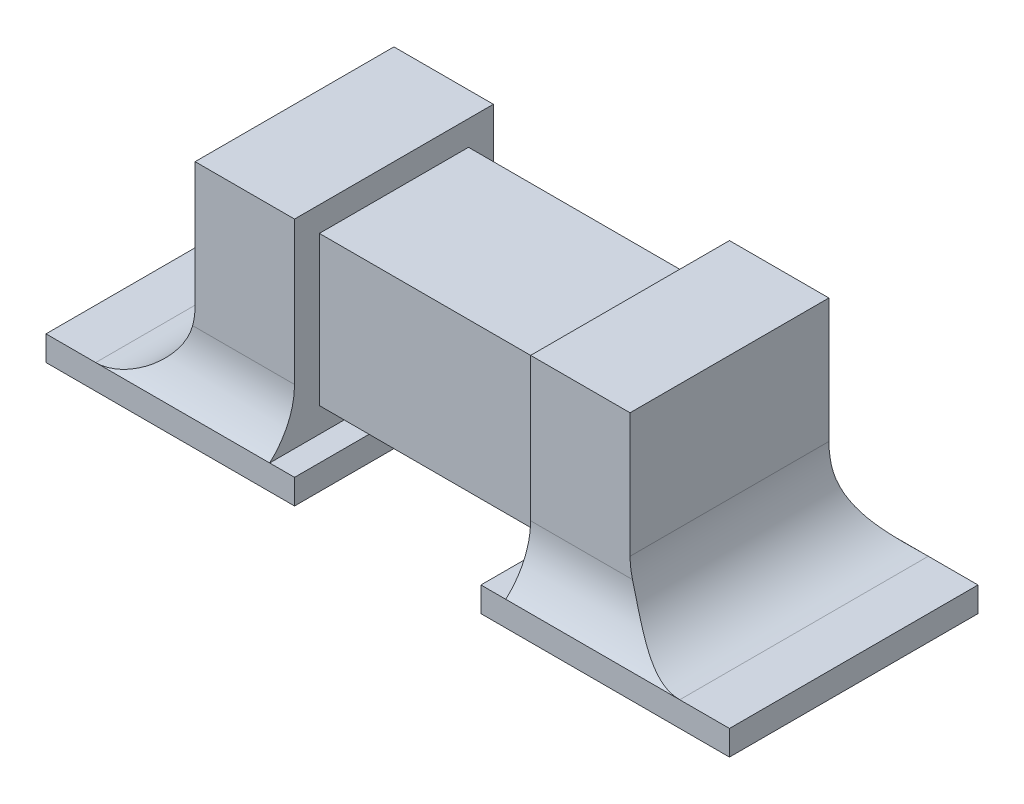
ISO-10303-21;
HEADER;
FILE_DESCRIPTION(('STEP AP214'),'2;1');
FILE_NAME('part.step','',(''),(''),'','','');
FILE_SCHEMA(('AUTOMOTIVE_DESIGN { 1 0 10303 214 1 1 1 1 }'));
ENDSEC;
DATA;
#1=APPLICATION_CONTEXT('core data for automotive mechanical design processes');
#2=APPLICATION_PROTOCOL_DEFINITION('international standard','automotive_design',2000,#1);
#3=PRODUCT_CONTEXT('',#1,'mechanical');
#4=PRODUCT('Part','Part','',(#3));
#5=PRODUCT_RELATED_PRODUCT_CATEGORY('part','',(#4));
#6=PRODUCT_DEFINITION_FORMATION('','',#4);
#7=PRODUCT_DEFINITION_CONTEXT('part definition',#1,'design');
#8=PRODUCT_DEFINITION('design','',#6,#7);
#9=PRODUCT_DEFINITION_SHAPE('','',#8);
#10=(LENGTH_UNIT() NAMED_UNIT(*) SI_UNIT(.MILLI.,.METRE.));
#11=(NAMED_UNIT(*) PLANE_ANGLE_UNIT() SI_UNIT($,.RADIAN.));
#12=(NAMED_UNIT(*) SI_UNIT($,.STERADIAN.) SOLID_ANGLE_UNIT());
#13=UNCERTAINTY_MEASURE_WITH_UNIT(LENGTH_MEASURE(1.E-05),#10,'distance_accuracy_value','');
#14=(GEOMETRIC_REPRESENTATION_CONTEXT(3) GLOBAL_UNCERTAINTY_ASSIGNED_CONTEXT((#13)) GLOBAL_UNIT_ASSIGNED_CONTEXT((#10,
#11,#12)) REPRESENTATION_CONTEXT('',''));
#15=CARTESIAN_POINT('',(0.,0.,0.));
#16=DIRECTION('',(0.,0.,1.));
#17=DIRECTION('',(1.,0.,0.));
#18=AXIS2_PLACEMENT_3D('',#15,#16,#17);
#19=CARTESIAN_POINT('',(0.475,0.9,-0.4));
#20=DIRECTION('',(1.,0.,0.));
#21=DIRECTION('',(0.,0.,-1.));
#22=AXIS2_PLACEMENT_3D('',#19,#20,#21);
#23=PLANE('',#22);
#24=DIRECTION('',(0.,-1.,0.));
#25=VECTOR('',#24,1.);
#26=CARTESIAN_POINT('',(0.474999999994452,0.8,0.3));
#27=LINE('',#26,#25);
#28=CARTESIAN_POINT('',(0.474999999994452,0.8,0.3));
#29=VERTEX_POINT('',#28);
#30=CARTESIAN_POINT('',(0.474999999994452,0.2,0.3));
#31=VERTEX_POINT('',#30);
#32=EDGE_CURVE('E88',#29,#31,#27,.T.);
#33=ORIENTED_EDGE('',*,*,#32,.T.);
#34=DIRECTION('',(0.,0.,-1.));
#35=VECTOR('',#34,1.);
#36=CARTESIAN_POINT('',(0.474999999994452,0.2,0.300000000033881));
#37=LINE('',#36,#35);
#38=CARTESIAN_POINT('',(0.474999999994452,0.2,-0.3));
#39=VERTEX_POINT('',#38);
#40=EDGE_CURVE('E93',#31,#39,#37,.T.);
#41=ORIENTED_EDGE('',*,*,#40,.T.);
#42=DIRECTION('',(0.,1.,0.));
#43=VECTOR('',#42,1.);
#44=CARTESIAN_POINT('',(0.474999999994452,0.8,-0.3));
#45=LINE('',#44,#43);
#46=CARTESIAN_POINT('',(0.474999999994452,0.8,-0.3));
#47=VERTEX_POINT('',#46);
#48=EDGE_CURVE('E90',#39,#47,#45,.T.);
#49=ORIENTED_EDGE('',*,*,#48,.T.);
#50=DIRECTION('',(0.,0.,1.));
#51=VECTOR('',#50,1.);
#52=CARTESIAN_POINT('',(0.474999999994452,0.8,0.300000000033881));
#53=LINE('',#52,#51);
#54=EDGE_CURVE('E47',#47,#29,#53,.T.);
#55=ORIENTED_EDGE('',*,*,#54,.T.);
#56=EDGE_LOOP('',(#33,#41,#49,#55));
#57=FACE_BOUND('',#56,.T.);
#58=ADVANCED_FACE('F43',(#57),#23,.T.);
#59=CARTESIAN_POINT('',(500000.,0.8,0.3));
#60=DIRECTION('',(0.,0.,-1.));
#61=DIRECTION('',(0.,1.,0.));
#62=AXIS2_PLACEMENT_3D('',#59,#60,#61);
#63=PLANE('',#62);
#64=ORIENTED_EDGE('',*,*,#32,.F.);
#65=DIRECTION('',(-1.,0.,0.));
#66=VECTOR('',#65,1.);
#67=CARTESIAN_POINT('',(500000.,0.8,0.3));
#68=LINE('',#67,#66);
#69=CARTESIAN_POINT('',(-0.475,0.8,0.3));
#70=VERTEX_POINT('',#69);
#71=EDGE_CURVE('E59',#29,#70,#68,.T.);
#72=ORIENTED_EDGE('',*,*,#71,.T.);
#73=DIRECTION('',(0.,-1.,0.));
#74=VECTOR('',#73,1.);
#75=CARTESIAN_POINT('',(-0.475,0.8,0.3));
#76=LINE('',#75,#74);
#77=CARTESIAN_POINT('',(-0.475,0.2,0.3));
#78=VERTEX_POINT('',#77);
#79=EDGE_CURVE('E12',#70,#78,#76,.T.);
#80=ORIENTED_EDGE('',*,*,#79,.T.);
#81=DIRECTION('',(-1.,0.,0.));
#82=VECTOR('',#81,1.);
#83=CARTESIAN_POINT('',(500000.,0.2,0.3));
#84=LINE('',#83,#82);
#85=EDGE_CURVE('E92',#31,#78,#84,.T.);
#86=ORIENTED_EDGE('',*,*,#85,.F.);
#87=EDGE_LOOP('',(#64,#72,#80,#86));
#88=FACE_BOUND('',#87,.T.);
#89=ADVANCED_FACE('F91',(#88),#63,.F.);
#90=CARTESIAN_POINT('',(500000.,0.2,0.3));
#91=DIRECTION('',(0.,1.,0.));
#92=DIRECTION('',(0.,0.,1.));
#93=AXIS2_PLACEMENT_3D('',#90,#91,#92);
#94=PLANE('',#93);
#95=ORIENTED_EDGE('',*,*,#40,.F.);
#96=ORIENTED_EDGE('',*,*,#85,.T.);
#97=DIRECTION('',(0.,0.,-1.));
#98=VECTOR('',#97,1.);
#99=CARTESIAN_POINT('',(-0.475,0.2,0.3));
#100=LINE('',#99,#98);
#101=CARTESIAN_POINT('',(-0.475,0.2,-0.3));
#102=VERTEX_POINT('',#101);
#103=EDGE_CURVE('E52',#78,#102,#100,.T.);
#104=ORIENTED_EDGE('',*,*,#103,.T.);
#105=DIRECTION('',(-1.,0.,0.));
#106=VECTOR('',#105,1.);
#107=CARTESIAN_POINT('',(500000.,0.2,-0.3));
#108=LINE('',#107,#106);
#109=EDGE_CURVE('E101',#39,#102,#108,.T.);
#110=ORIENTED_EDGE('',*,*,#109,.F.);
#111=EDGE_LOOP('',(#95,#96,#104,#110));
#112=FACE_BOUND('',#111,.T.);
#113=ADVANCED_FACE('F108',(#112),#94,.F.);
#114=CARTESIAN_POINT('',(500000.,0.8,-0.3));
#115=DIRECTION('',(0.,0.,1.));
#116=DIRECTION('',(0.,-1.,0.));
#117=AXIS2_PLACEMENT_3D('',#114,#115,#116);
#118=PLANE('',#117);
#119=ORIENTED_EDGE('',*,*,#48,.F.);
#120=ORIENTED_EDGE('',*,*,#109,.T.);
#121=DIRECTION('',(0.,1.,0.));
#122=VECTOR('',#121,1.);
#123=CARTESIAN_POINT('',(-0.475,0.8,-0.3));
#124=LINE('',#123,#122);
#125=CARTESIAN_POINT('',(-0.475,0.8,-0.3));
#126=VERTEX_POINT('',#125);
#127=EDGE_CURVE('E99',#102,#126,#124,.T.);
#128=ORIENTED_EDGE('',*,*,#127,.T.);
#129=DIRECTION('',(-1.,0.,0.));
#130=VECTOR('',#129,1.);
#131=CARTESIAN_POINT('',(500000.,0.8,-0.3));
#132=LINE('',#131,#130);
#133=EDGE_CURVE('E66',#47,#126,#132,.T.);
#134=ORIENTED_EDGE('',*,*,#133,.F.);
#135=EDGE_LOOP('',(#119,#120,#128,#134));
#136=FACE_BOUND('',#135,.T.);
#137=ADVANCED_FACE('F115',(#136),#118,.F.);
#138=CARTESIAN_POINT('',(500000.,0.8,0.3));
#139=DIRECTION('',(0.,-1.,0.));
#140=DIRECTION('',(0.,0.,-1.));
#141=AXIS2_PLACEMENT_3D('',#138,#139,#140);
#142=PLANE('',#141);
#143=ORIENTED_EDGE('',*,*,#54,.F.);
#144=ORIENTED_EDGE('',*,*,#133,.T.);
#145=DIRECTION('',(0.,0.,1.));
#146=VECTOR('',#145,1.);
#147=CARTESIAN_POINT('',(-0.475,0.8,0.3));
#148=LINE('',#147,#146);
#149=EDGE_CURVE('E96',#126,#70,#148,.T.);
#150=ORIENTED_EDGE('',*,*,#149,.T.);
#151=ORIENTED_EDGE('',*,*,#71,.F.);
#152=EDGE_LOOP('',(#143,#144,#150,#151));
#153=FACE_BOUND('',#152,.T.);
#154=ADVANCED_FACE('F45',(#153),#142,.F.);
#155=CARTESIAN_POINT('',(-0.475,0.,0.));
#156=DIRECTION('',(1.,0.,0.));
#157=DIRECTION('',(0.,0.,-1.));
#158=AXIS2_PLACEMENT_3D('',#155,#156,#157);
#159=PLANE('',#158);
#160=ORIENTED_EDGE('',*,*,#79,.F.);
#161=ORIENTED_EDGE('',*,*,#149,.F.);
#162=ORIENTED_EDGE('',*,*,#127,.F.);
#163=ORIENTED_EDGE('',*,*,#103,.F.);
#164=EDGE_LOOP('',(#160,#161,#162,#163));
#165=FACE_BOUND('',#164,.T.);
#166=ADVANCED_FACE('F117',(#165),#159,.F.);
#167=CLOSED_SHELL('',(#58,#89,#113,#137,#154,#166));
#168=MANIFOLD_SOLID_BREP('B2',#167);
#169=CARTESIAN_POINT('',(0.,0.1,0.));
#170=DIRECTION('',(0.,1.,0.));
#171=DIRECTION('',(0.,0.,1.));
#172=AXIS2_PLACEMENT_3D('',#169,#170,#171);
#173=PLANE('',#172);
#174=DIRECTION('',(0.,0.,1.));
#175=VECTOR('',#174,1.);
#176=CARTESIAN_POINT('',(0.475,0.1,-0.4));
#177=LINE('',#176,#175);
#178=CARTESIAN_POINT('',(0.475,0.1,-0.5));
#179=VERTEX_POINT('',#178);
#180=CARTESIAN_POINT('',(0.475,0.1,0.5));
#181=VERTEX_POINT('',#180);
#182=EDGE_CURVE('E284',#179,#181,#177,.T.);
#183=ORIENTED_EDGE('',*,*,#182,.F.);
#184=DIRECTION('',(-1.,0.,0.));
#185=VECTOR('',#184,1.);
#186=CARTESIAN_POINT('',(0.375,0.1,-0.5));
#187=LINE('',#186,#185);
#188=CARTESIAN_POINT('',(0.375,0.1,-0.5));
#189=VERTEX_POINT('',#188);
#190=EDGE_CURVE('E308',#179,#189,#187,.T.);
#191=ORIENTED_EDGE('',*,*,#190,.T.);
#192=DIRECTION('',(0.,0.,1.));
#193=VECTOR('',#192,1.);
#194=CARTESIAN_POINT('',(0.375,0.1,-0.5));
#195=LINE('',#194,#193);
#196=CARTESIAN_POINT('',(0.375,0.1,0.5));
#197=VERTEX_POINT('',#196);
#198=EDGE_CURVE('E297',#189,#197,#195,.T.);
#199=ORIENTED_EDGE('',*,*,#198,.T.);
#200=DIRECTION('',(1.,0.,0.));
#201=VECTOR('',#200,1.);
#202=CARTESIAN_POINT('',(0.375,0.1,0.5));
#203=LINE('',#202,#201);
#204=EDGE_CURVE('E302',#197,#181,#203,.T.);
#205=ORIENTED_EDGE('',*,*,#204,.T.);
#206=EDGE_LOOP('',(#183,#191,#199,#205));
#207=FACE_BOUND('',#206,.T.);
#208=ADVANCED_FACE('F175',(#207),#173,.T.);
#209=CARTESIAN_POINT('',(1.375,0.1,-0.5));
#210=VERTEX_POINT('',#209);
#211=CARTESIAN_POINT('',(1.175,0.1,-0.5));
#212=VERTEX_POINT('',#211);
#213=EDGE_CURVE('E309',#210,#212,#187,.T.);
#214=ORIENTED_EDGE('',*,*,#213,.T.);
#215=DIRECTION('',(0.,0.,-1.));
#216=VECTOR('',#215,1.);
#217=CARTESIAN_POINT('',(1.175,0.1,0.));
#218=LINE('',#217,#216);
#219=CARTESIAN_POINT('',(1.175,0.1,0.5));
#220=VERTEX_POINT('',#219);
#221=EDGE_CURVE('E330',#212,#220,#218,.F.);
#222=ORIENTED_EDGE('',*,*,#221,.T.);
#223=CARTESIAN_POINT('',(1.375,0.1,0.5));
#224=VERTEX_POINT('',#223);
#225=EDGE_CURVE('E300',#220,#224,#203,.T.);
#226=ORIENTED_EDGE('',*,*,#225,.T.);
#227=DIRECTION('',(0.,0.,-1.));
#228=VECTOR('',#227,1.);
#229=CARTESIAN_POINT('',(1.375,0.1,-0.5));
#230=LINE('',#229,#228);
#231=EDGE_CURVE('E305',#224,#210,#230,.T.);
#232=ORIENTED_EDGE('',*,*,#231,.T.);
#233=EDGE_LOOP('',(#214,#222,#226,#232));
#234=FACE_BOUND('',#233,.T.);
#235=ADVANCED_FACE('F356',(#234),#173,.T.);
#236=CARTESIAN_POINT('',(0.375,0.1,-0.5));
#237=DIRECTION('',(1.,0.,0.));
#238=DIRECTION('',(0.,0.,-1.));
#239=AXIS2_PLACEMENT_3D('',#236,#237,#238);
#240=PLANE('',#239);
#241=DIRECTION('',(0.,0.,1.));
#242=VECTOR('',#241,1.);
#243=CARTESIAN_POINT('',(0.375,0.,-0.5));
#244=LINE('',#243,#242);
#245=CARTESIAN_POINT('',(0.375,0.,-0.5));
#246=VERTEX_POINT('',#245);
#247=CARTESIAN_POINT('',(0.375,0.,0.5));
#248=VERTEX_POINT('',#247);
#249=EDGE_CURVE('E288',#246,#248,#244,.T.);
#250=ORIENTED_EDGE('',*,*,#249,.T.);
#251=DIRECTION('',(0.,-1.,0.));
#252=VECTOR('',#251,1.);
#253=CARTESIAN_POINT('',(0.375,0.1,0.5));
#254=LINE('',#253,#252);
#255=EDGE_CURVE('E326',#197,#248,#254,.T.);
#256=ORIENTED_EDGE('',*,*,#255,.F.);
#257=ORIENTED_EDGE('',*,*,#198,.F.);
#258=DIRECTION('',(0.,-1.,0.));
#259=VECTOR('',#258,1.);
#260=CARTESIAN_POINT('',(0.375,0.1,-0.5));
#261=LINE('',#260,#259);
#262=EDGE_CURVE('E311',#189,#246,#261,.T.);
#263=ORIENTED_EDGE('',*,*,#262,.T.);
#264=EDGE_LOOP('',(#250,#256,#257,#263));
#265=FACE_BOUND('',#264,.T.);
#266=ADVANCED_FACE('F362',(#265),#240,.F.);
#267=CARTESIAN_POINT('',(0.375,0.1,0.5));
#268=DIRECTION('',(0.,0.,-1.));
#269=DIRECTION('',(-1.,0.,0.));
#270=AXIS2_PLACEMENT_3D('',#267,#268,#269);
#271=PLANE('',#270);
#272=DIRECTION('',(1.,0.,0.));
#273=VECTOR('',#272,1.);
#274=CARTESIAN_POINT('',(0.375,0.,0.5));
#275=LINE('',#274,#273);
#276=CARTESIAN_POINT('',(1.375,0.,0.5));
#277=VERTEX_POINT('',#276);
#278=EDGE_CURVE('E291',#248,#277,#275,.T.);
#279=ORIENTED_EDGE('',*,*,#278,.T.);
#280=DIRECTION('',(0.,-1.,0.));
#281=VECTOR('',#280,1.);
#282=CARTESIAN_POINT('',(1.375,0.1,0.5));
#283=LINE('',#282,#281);
#284=EDGE_CURVE('E323',#224,#277,#283,.T.);
#285=ORIENTED_EDGE('',*,*,#284,.F.);
#286=ORIENTED_EDGE('',*,*,#225,.F.);
#287=EDGE_CURVE('E306',#181,#220,#203,.T.);
#288=ORIENTED_EDGE('',*,*,#287,.F.);
#289=ORIENTED_EDGE('',*,*,#204,.F.);
#290=ORIENTED_EDGE('',*,*,#255,.T.);
#291=EDGE_LOOP('',(#279,#285,#286,#288,#289,#290));
#292=FACE_BOUND('',#291,.T.);
#293=ADVANCED_FACE('F378',(#292),#271,.F.);
#294=CARTESIAN_POINT('',(1.375,0.1,-0.5));
#295=DIRECTION('',(-1.,0.,0.));
#296=DIRECTION('',(0.,0.,1.));
#297=AXIS2_PLACEMENT_3D('',#294,#295,#296);
#298=PLANE('',#297);
#299=DIRECTION('',(0.,0.,-1.));
#300=VECTOR('',#299,1.);
#301=CARTESIAN_POINT('',(1.375,0.,-0.5));
#302=LINE('',#301,#300);
#303=CARTESIAN_POINT('',(1.375,0.,-0.5));
#304=VERTEX_POINT('',#303);
#305=EDGE_CURVE('E315',#277,#304,#302,.T.);
#306=ORIENTED_EDGE('',*,*,#305,.T.);
#307=DIRECTION('',(0.,-1.,0.));
#308=VECTOR('',#307,1.);
#309=CARTESIAN_POINT('',(1.375,0.1,-0.5));
#310=LINE('',#309,#308);
#311=EDGE_CURVE('E320',#210,#304,#310,.T.);
#312=ORIENTED_EDGE('',*,*,#311,.F.);
#313=ORIENTED_EDGE('',*,*,#231,.F.);
#314=ORIENTED_EDGE('',*,*,#284,.T.);
#315=EDGE_LOOP('',(#306,#312,#313,#314));
#316=FACE_BOUND('',#315,.T.);
#317=ADVANCED_FACE('F374',(#316),#298,.F.);
#318=CARTESIAN_POINT('',(0.375,0.1,-0.5));
#319=DIRECTION('',(0.,0.,1.));
#320=DIRECTION('',(1.,0.,0.));
#321=AXIS2_PLACEMENT_3D('',#318,#319,#320);
#322=PLANE('',#321);
#323=DIRECTION('',(-1.,0.,0.));
#324=VECTOR('',#323,1.);
#325=CARTESIAN_POINT('',(0.375,0.,-0.5));
#326=LINE('',#325,#324);
#327=EDGE_CURVE('E301',#304,#246,#326,.T.);
#328=ORIENTED_EDGE('',*,*,#327,.T.);
#329=ORIENTED_EDGE('',*,*,#262,.F.);
#330=ORIENTED_EDGE('',*,*,#190,.F.);
#331=EDGE_CURVE('E312',#212,#179,#187,.T.);
#332=ORIENTED_EDGE('',*,*,#331,.F.);
#333=ORIENTED_EDGE('',*,*,#213,.F.);
#334=ORIENTED_EDGE('',*,*,#311,.T.);
#335=EDGE_LOOP('',(#328,#329,#330,#332,#333,#334));
#336=FACE_BOUND('',#335,.T.);
#337=ADVANCED_FACE('F370',(#336),#322,.F.);
#338=CARTESIAN_POINT('',(0.,0.,0.));
#339=DIRECTION('',(0.,1.,0.));
#340=DIRECTION('',(0.,0.,1.));
#341=AXIS2_PLACEMENT_3D('',#338,#339,#340);
#342=PLANE('',#341);
#343=ORIENTED_EDGE('',*,*,#249,.F.);
#344=ORIENTED_EDGE('',*,*,#327,.F.);
#345=ORIENTED_EDGE('',*,*,#305,.F.);
#346=ORIENTED_EDGE('',*,*,#278,.F.);
#347=EDGE_LOOP('',(#343,#344,#345,#346));
#348=FACE_BOUND('',#347,.T.);
#349=ADVANCED_FACE('F367',(#348),#342,.F.);
#350=CARTESIAN_POINT('',(0.475,0.9,-0.4));
#351=DIRECTION('',(1.,0.,0.));
#352=DIRECTION('',(0.,0.,-1.));
#353=AXIS2_PLACEMENT_3D('',#350,#351,#352);
#354=PLANE('',#353);
#355=ORIENTED_EDGE('',*,*,#182,.T.);
#356=CARTESIAN_POINT('',(0.475,0.323606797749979,0.7));
#357=DIRECTION('',(1.,0.,0.));
#358=DIRECTION('',(0.,0.,-1.));
#359=AXIS2_PLACEMENT_3D('',#356,#357,#358);
#360=CIRCLE('',#359,0.3);
#361=CARTESIAN_POINT('',(0.475,0.323606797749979,0.4));
#362=VERTEX_POINT('',#361);
#363=EDGE_CURVE('E41',#181,#362,#360,.T.);
#364=ORIENTED_EDGE('',*,*,#363,.T.);
#365=DIRECTION('',(0.,-1.,0.));
#366=VECTOR('',#365,1.);
#367=CARTESIAN_POINT('',(0.475,0.9,0.4));
#368=LINE('',#367,#366);
#369=CARTESIAN_POINT('',(0.475,0.9,0.4));
#370=VERTEX_POINT('',#369);
#371=EDGE_CURVE('E269',#370,#362,#368,.T.);
#372=ORIENTED_EDGE('',*,*,#371,.F.);
#373=DIRECTION('',(0.,0.,1.));
#374=VECTOR('',#373,1.);
#375=CARTESIAN_POINT('',(0.475,0.9,-0.4));
#376=LINE('',#375,#374);
#377=CARTESIAN_POINT('',(0.475,0.9,-0.4));
#378=VERTEX_POINT('',#377);
#379=EDGE_CURVE('E275',#378,#370,#376,.T.);
#380=ORIENTED_EDGE('',*,*,#379,.F.);
#381=DIRECTION('',(0.,-1.,0.));
#382=VECTOR('',#381,1.);
#383=CARTESIAN_POINT('',(0.475,0.9,-0.4));
#384=LINE('',#383,#382);
#385=CARTESIAN_POINT('',(0.475,0.323606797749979,-0.4));
#386=VERTEX_POINT('',#385);
#387=EDGE_CURVE('E411',#378,#386,#384,.T.);
#388=ORIENTED_EDGE('',*,*,#387,.T.);
#389=CARTESIAN_POINT('',(0.475,0.323606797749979,-0.7));
#390=DIRECTION('',(1.,0.,0.));
#391=DIRECTION('',(0.,0.,-1.));
#392=AXIS2_PLACEMENT_3D('',#389,#390,#391);
#393=CIRCLE('',#392,0.3);
#394=EDGE_CURVE('E335',#386,#179,#393,.T.);
#395=ORIENTED_EDGE('',*,*,#394,.T.);
#396=EDGE_LOOP('',(#355,#364,#372,#380,#388,#395));
#397=FACE_BOUND('',#396,.T.);
#398=ADVANCED_FACE('F286',(#397),#354,.F.);
#399=CARTESIAN_POINT('',(0.475,0.9,0.4));
#400=DIRECTION('',(0.,0.,-1.));
#401=DIRECTION('',(-1.,0.,0.));
#402=AXIS2_PLACEMENT_3D('',#399,#400,#401);
#403=PLANE('',#402);
#404=ORIENTED_EDGE('',*,*,#371,.T.);
#405=DIRECTION('',(-1.,0.,0.));
#406=VECTOR('',#405,1.);
#407=CARTESIAN_POINT('',(0.475,0.323606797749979,0.4));
#408=LINE('',#407,#406);
#409=CARTESIAN_POINT('',(0.884889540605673,0.323606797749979,0.4));
#410=VERTEX_POINT('',#409);
#411=EDGE_CURVE('E198',#362,#410,#408,.F.);
#412=ORIENTED_EDGE('',*,*,#411,.T.);
#413=CARTESIAN_POINT('',(1.175,0.4,0.4));
#414=DIRECTION('',(0.,0.,-1.));
#415=DIRECTION('',(-1.,0.,0.));
#416=AXIS2_PLACEMENT_3D('',#413,#414,#415);
#417=CIRCLE('',#416,0.3);
#418=CARTESIAN_POINT('',(0.875,0.4,0.4));
#419=VERTEX_POINT('',#418);
#420=EDGE_CURVE('E190',#410,#419,#417,.T.);
#421=ORIENTED_EDGE('',*,*,#420,.T.);
#422=DIRECTION('',(0.,-1.,0.));
#423=VECTOR('',#422,1.);
#424=CARTESIAN_POINT('',(0.875,0.9,0.4));
#425=LINE('',#424,#423);
#426=CARTESIAN_POINT('',(0.875,0.9,0.4));
#427=VERTEX_POINT('',#426);
#428=EDGE_CURVE('E271',#427,#419,#425,.T.);
#429=ORIENTED_EDGE('',*,*,#428,.F.);
#430=DIRECTION('',(1.,0.,0.));
#431=VECTOR('',#430,1.);
#432=CARTESIAN_POINT('',(0.475,0.9,0.4));
#433=LINE('',#432,#431);
#434=EDGE_CURVE('E265',#370,#427,#433,.T.);
#435=ORIENTED_EDGE('',*,*,#434,.F.);
#436=EDGE_LOOP('',(#404,#412,#421,#429,#435));
#437=FACE_BOUND('',#436,.T.);
#438=ADVANCED_FACE('F267',(#437),#403,.F.);
#439=CARTESIAN_POINT('',(0.875,0.9,-0.4));
#440=DIRECTION('',(-1.,0.,0.));
#441=DIRECTION('',(0.,0.,1.));
#442=AXIS2_PLACEMENT_3D('',#439,#440,#441);
#443=PLANE('',#442);
#444=ORIENTED_EDGE('',*,*,#428,.T.);
#445=DIRECTION('',(0.,0.,-1.));
#446=VECTOR('',#445,1.);
#447=CARTESIAN_POINT('',(0.875,0.4,-0.4));
#448=LINE('',#447,#446);
#449=CARTESIAN_POINT('',(0.875,0.4,-0.4));
#450=VERTEX_POINT('',#449);
#451=EDGE_CURVE('E332',#419,#450,#448,.T.);
#452=ORIENTED_EDGE('',*,*,#451,.T.);
#453=DIRECTION('',(0.,-1.,0.));
#454=VECTOR('',#453,1.);
#455=CARTESIAN_POINT('',(0.875,0.9,-0.4));
#456=LINE('',#455,#454);
#457=CARTESIAN_POINT('',(0.875,0.9,-0.4));
#458=VERTEX_POINT('',#457);
#459=EDGE_CURVE('E293',#458,#450,#456,.T.);
#460=ORIENTED_EDGE('',*,*,#459,.F.);
#461=DIRECTION('',(0.,0.,-1.));
#462=VECTOR('',#461,1.);
#463=CARTESIAN_POINT('',(0.875,0.9,-0.4));
#464=LINE('',#463,#462);
#465=EDGE_CURVE('E274',#427,#458,#464,.T.);
#466=ORIENTED_EDGE('',*,*,#465,.F.);
#467=EDGE_LOOP('',(#444,#452,#460,#466));
#468=FACE_BOUND('',#467,.T.);
#469=ADVANCED_FACE('F418',(#468),#443,.F.);
#470=CARTESIAN_POINT('',(0.475,0.9,-0.4));
#471=DIRECTION('',(0.,0.,1.));
#472=DIRECTION('',(1.,0.,0.));
#473=AXIS2_PLACEMENT_3D('',#470,#471,#472);
#474=PLANE('',#473);
#475=ORIENTED_EDGE('',*,*,#459,.T.);
#476=CARTESIAN_POINT('',(1.175,0.4,-0.4));
#477=DIRECTION('',(0.,0.,1.));
#478=DIRECTION('',(1.,0.,0.));
#479=AXIS2_PLACEMENT_3D('',#476,#477,#478);
#480=CIRCLE('',#479,0.3);
#481=CARTESIAN_POINT('',(0.884889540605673,0.323606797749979,-0.4));
#482=VERTEX_POINT('',#481);
#483=EDGE_CURVE('E338',#450,#482,#480,.T.);
#484=ORIENTED_EDGE('',*,*,#483,.T.);
#485=DIRECTION('',(1.,0.,0.));
#486=VECTOR('',#485,1.);
#487=CARTESIAN_POINT('',(0.475,0.323606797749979,-0.4));
#488=LINE('',#487,#486);
#489=EDGE_CURVE('E206',#482,#386,#488,.F.);
#490=ORIENTED_EDGE('',*,*,#489,.T.);
#491=ORIENTED_EDGE('',*,*,#387,.F.);
#492=DIRECTION('',(-1.,0.,0.));
#493=VECTOR('',#492,1.);
#494=CARTESIAN_POINT('',(0.475,0.9,-0.4));
#495=LINE('',#494,#493);
#496=EDGE_CURVE('E280',#458,#378,#495,.T.);
#497=ORIENTED_EDGE('',*,*,#496,.F.);
#498=EDGE_LOOP('',(#475,#484,#490,#491,#497));
#499=FACE_BOUND('',#498,.T.);
#500=ADVANCED_FACE('F416',(#499),#474,.F.);
#501=CARTESIAN_POINT('',(0.,0.9,0.));
#502=DIRECTION('',(0.,1.,0.));
#503=DIRECTION('',(0.,0.,1.));
#504=AXIS2_PLACEMENT_3D('',#501,#502,#503);
#505=PLANE('',#504);
#506=ORIENTED_EDGE('',*,*,#379,.T.);
#507=ORIENTED_EDGE('',*,*,#434,.T.);
#508=ORIENTED_EDGE('',*,*,#465,.T.);
#509=ORIENTED_EDGE('',*,*,#496,.T.);
#510=EDGE_LOOP('',(#506,#507,#508,#509));
#511=FACE_BOUND('',#510,.T.);
#512=ADVANCED_FACE('F278',(#511),#505,.T.);
#513=CARTESIAN_POINT('',(0.,0.323606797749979,0.7));
#514=DIRECTION('',(-1.,0.,0.));
#515=DIRECTION('',(0.,0.,1.));
#516=AXIS2_PLACEMENT_3D('',#513,#514,#515);
#517=CYLINDRICAL_SURFACE('',#516,0.3);
#518=ORIENTED_EDGE('',*,*,#363,.F.);
#519=ORIENTED_EDGE('',*,*,#287,.T.);
#520=CARTESIAN_POINT('',(1.175,0.1,0.5));
#521=CARTESIAN_POINT('',(1.16046022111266,0.0999816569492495,0.500065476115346));
#522=CARTESIAN_POINT('',(1.1460357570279,0.101054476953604,0.498814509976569));
#523=CARTESIAN_POINT('',(1.11796604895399,0.105140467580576,0.494365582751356));
#524=CARTESIAN_POINT('',(1.10431276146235,0.108126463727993,0.491194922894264));
#525=CARTESIAN_POINT('',(1.07498976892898,0.11665828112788,0.482713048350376));
#526=CARTESIAN_POINT('',(1.0595423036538,0.122624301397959,0.477083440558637));
#527=CARTESIAN_POINT('',(1.02998952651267,0.136860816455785,0.465022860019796));
#528=CARTESIAN_POINT('',(1.01589296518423,0.145145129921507,0.458587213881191));
#529=CARTESIAN_POINT('',(0.988938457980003,0.164081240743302,0.445666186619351));
#530=CARTESIAN_POINT('',(0.976109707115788,0.174775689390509,0.439182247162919));
#531=CARTESIAN_POINT('',(0.952231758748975,0.19837060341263,0.427069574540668));
#532=CARTESIAN_POINT('',(0.94117789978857,0.211265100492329,0.421438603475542));
#533=CARTESIAN_POINT('',(0.923455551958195,0.235982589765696,0.412854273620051));
#534=CARTESIAN_POINT('',(0.916360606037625,0.247388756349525,0.409583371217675));
#535=CARTESIAN_POINT('',(0.90368656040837,0.271275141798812,0.404349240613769));
#536=CARTESIAN_POINT('',(0.898103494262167,0.283752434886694,0.402382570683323));
#537=CARTESIAN_POINT('',(0.890131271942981,0.30544761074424,0.400416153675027));
#538=CARTESIAN_POINT('',(0.887289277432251,0.314465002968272,0.399993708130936));
#539=CARTESIAN_POINT('',(0.884889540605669,0.323606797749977,0.399999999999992));
#540=B_SPLINE_CURVE_WITH_KNOTS('',3,(#520,#521,#522,#523,#524,#525,#526,#527,#528,#529,#530,
#531,#532,#533,#534,#535,#536,#537,#538,#539),.UNSPECIFIED.,.F.,.F.,(4,2,2,2,2,2,2,2,2,4),(0.,
0.0433450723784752,0.0860877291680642,0.138287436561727,0.190805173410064,0.244337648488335,
0.297727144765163,0.339046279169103,0.380255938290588,0.408582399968),.UNSPECIFIED.);
#541=EDGE_CURVE('E180',#410,#220,#540,.F.);
#542=ORIENTED_EDGE('',*,*,#541,.F.);
#543=ORIENTED_EDGE('',*,*,#411,.F.);
#544=EDGE_LOOP('',(#518,#519,#542,#543));
#545=FACE_BOUND('',#544,.T.);
#546=ADVANCED_FACE('F177',(#545),#517,.F.);
#547=CARTESIAN_POINT('',(1.175,0.4,-0.4));
#548=DIRECTION('',(0.,0.,-1.));
#549=DIRECTION('',(-1.,0.,0.));
#550=AXIS2_PLACEMENT_3D('',#547,#548,#549);
#551=CYLINDRICAL_SURFACE('',#550,0.3);
#552=ORIENTED_EDGE('',*,*,#541,.T.);
#553=ORIENTED_EDGE('',*,*,#221,.F.);
#554=CARTESIAN_POINT('',(1.175,0.1,-0.5));
#555=CARTESIAN_POINT('',(1.16046022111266,0.0999816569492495,-0.500065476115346));
#556=CARTESIAN_POINT('',(1.1460357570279,0.101054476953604,-0.498814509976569));
#557=CARTESIAN_POINT('',(1.11796604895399,0.105140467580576,-0.494365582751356));
#558=CARTESIAN_POINT('',(1.10431276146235,0.108126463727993,-0.491194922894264));
#559=CARTESIAN_POINT('',(1.07498976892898,0.11665828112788,-0.482713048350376));
#560=CARTESIAN_POINT('',(1.0595423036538,0.122624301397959,-0.477083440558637));
#561=CARTESIAN_POINT('',(1.02998952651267,0.136860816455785,-0.465022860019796));
#562=CARTESIAN_POINT('',(1.01589296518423,0.145145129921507,-0.458587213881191));
#563=CARTESIAN_POINT('',(0.988938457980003,0.164081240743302,-0.445666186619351));
#564=CARTESIAN_POINT('',(0.976109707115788,0.174775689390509,-0.439182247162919));
#565=CARTESIAN_POINT('',(0.952231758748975,0.19837060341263,-0.427069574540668));
#566=CARTESIAN_POINT('',(0.94117789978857,0.211265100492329,-0.421438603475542));
#567=CARTESIAN_POINT('',(0.923455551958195,0.235982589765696,-0.412854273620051));
#568=CARTESIAN_POINT('',(0.916360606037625,0.247388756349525,-0.409583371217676));
#569=CARTESIAN_POINT('',(0.90368656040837,0.271275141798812,-0.404349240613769));
#570=CARTESIAN_POINT('',(0.898103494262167,0.283752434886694,-0.402382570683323));
#571=CARTESIAN_POINT('',(0.890131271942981,0.30544761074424,-0.400416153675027));
#572=CARTESIAN_POINT('',(0.887289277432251,0.314465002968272,-0.399993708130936));
#573=CARTESIAN_POINT('',(0.884889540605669,0.323606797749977,-0.399999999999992));
#574=B_SPLINE_CURVE_WITH_KNOTS('',3,(#554,#555,#556,#557,#558,#559,#560,#561,#562,#563,#564,
#565,#566,#567,#568,#569,#570,#571,#572,#573),.UNSPECIFIED.,.F.,.F.,(4,2,2,2,2,2,2,2,2,4),(0.,
0.0433450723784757,0.0860877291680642,0.138287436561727,0.190805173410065,0.244337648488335,
0.297727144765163,0.339046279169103,0.380255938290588,0.408582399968),.UNSPECIFIED.);
#575=EDGE_CURVE('E340',#482,#212,#574,.F.);
#576=ORIENTED_EDGE('',*,*,#575,.F.);
#577=ORIENTED_EDGE('',*,*,#483,.F.);
#578=ORIENTED_EDGE('',*,*,#451,.F.);
#579=ORIENTED_EDGE('',*,*,#420,.F.);
#580=EDGE_LOOP('',(#552,#553,#576,#577,#578,#579));
#581=FACE_BOUND('',#580,.T.);
#582=ADVANCED_FACE('F345',(#581),#551,.F.);
#583=CARTESIAN_POINT('',(0.,0.323606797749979,-0.7));
#584=DIRECTION('',(1.,0.,0.));
#585=DIRECTION('',(0.,0.,-1.));
#586=AXIS2_PLACEMENT_3D('',#583,#584,#585);
#587=CYLINDRICAL_SURFACE('',#586,0.3);
#588=ORIENTED_EDGE('',*,*,#575,.T.);
#589=ORIENTED_EDGE('',*,*,#331,.T.);
#590=ORIENTED_EDGE('',*,*,#394,.F.);
#591=ORIENTED_EDGE('',*,*,#489,.F.);
#592=EDGE_LOOP('',(#588,#589,#590,#591));
#593=FACE_BOUND('',#592,.T.);
#594=ADVANCED_FACE('F348',(#593),#587,.F.);
#595=CLOSED_SHELL('',(#208,#235,#266,#293,#317,#337,#349,#398,#438,#469,#500,#512,#546,#582,#594));
#596=MANIFOLD_SOLID_BREP('B6',#595);
#597=CARTESIAN_POINT('',(0.,0.1,0.));
#598=DIRECTION('',(0.,-1.,0.));
#599=DIRECTION('',(0.,0.,-1.));
#600=AXIS2_PLACEMENT_3D('',#597,#598,#599);
#601=PLANE('',#600);
#602=DIRECTION('',(-1.,0.,0.));
#603=VECTOR('',#602,1.);
#604=CARTESIAN_POINT('',(-0.375,0.1,-0.5));
#605=LINE('',#604,#603);
#606=CARTESIAN_POINT('',(-0.375,0.1,-0.5));
#607=VERTEX_POINT('',#606);
#608=CARTESIAN_POINT('',(-0.475,0.1,-0.5));
#609=VERTEX_POINT('',#608);
#610=EDGE_CURVE('E648',#607,#609,#605,.T.);
#611=ORIENTED_EDGE('',*,*,#610,.T.);
#612=DIRECTION('',(0.,0.,-1.));
#613=VECTOR('',#612,1.);
#614=CARTESIAN_POINT('',(-0.475,0.1,-0.4));
#615=LINE('',#614,#613);
#616=CARTESIAN_POINT('',(-0.475,0.1,0.5));
#617=VERTEX_POINT('',#616);
#618=EDGE_CURVE('E629',#617,#609,#615,.T.);
#619=ORIENTED_EDGE('',*,*,#618,.F.);
#620=DIRECTION('',(1.,0.,0.));
#621=VECTOR('',#620,1.);
#622=CARTESIAN_POINT('',(-0.375,0.1,0.5));
#623=LINE('',#622,#621);
#624=CARTESIAN_POINT('',(-0.375,0.1,0.5));
#625=VERTEX_POINT('',#624);
#626=EDGE_CURVE('E654',#617,#625,#623,.T.);
#627=ORIENTED_EDGE('',*,*,#626,.T.);
#628=DIRECTION('',(0.,0.,-1.));
#629=VECTOR('',#628,1.);
#630=CARTESIAN_POINT('',(-0.375,0.1,-0.5));
#631=LINE('',#630,#629);
#632=EDGE_CURVE('E643',#625,#607,#631,.T.);
#633=ORIENTED_EDGE('',*,*,#632,.T.);
#634=EDGE_LOOP('',(#611,#619,#627,#633));
#635=FACE_BOUND('',#634,.T.);
#636=ADVANCED_FACE('F515',(#635),#601,.F.);
#637=CARTESIAN_POINT('',(-1.375,0.1,0.5));
#638=VERTEX_POINT('',#637);
#639=CARTESIAN_POINT('',(-1.175,0.1,0.5));
#640=VERTEX_POINT('',#639);
#641=EDGE_CURVE('E655',#638,#640,#623,.T.);
#642=ORIENTED_EDGE('',*,*,#641,.T.);
#643=DIRECTION('',(0.,0.,1.));
#644=VECTOR('',#643,1.);
#645=CARTESIAN_POINT('',(-1.175,0.1,-0.4));
#646=LINE('',#645,#644);
#647=CARTESIAN_POINT('',(-1.175,0.1,-0.5));
#648=VERTEX_POINT('',#647);
#649=EDGE_CURVE('E677',#640,#648,#646,.F.);
#650=ORIENTED_EDGE('',*,*,#649,.T.);
#651=CARTESIAN_POINT('',(-1.375,0.1,-0.5));
#652=VERTEX_POINT('',#651);
#653=EDGE_CURVE('E646',#648,#652,#605,.T.);
#654=ORIENTED_EDGE('',*,*,#653,.T.);
#655=DIRECTION('',(0.,0.,1.));
#656=VECTOR('',#655,1.);
#657=CARTESIAN_POINT('',(-1.375,0.1,-0.5));
#658=LINE('',#657,#656);
#659=EDGE_CURVE('E651',#652,#638,#658,.T.);
#660=ORIENTED_EDGE('',*,*,#659,.T.);
#661=EDGE_LOOP('',(#642,#650,#654,#660));
#662=FACE_BOUND('',#661,.T.);
#663=ADVANCED_FACE('F732',(#662),#601,.F.);
#664=CARTESIAN_POINT('',(-0.375,0.1,-0.5));
#665=DIRECTION('',(-1.,0.,0.));
#666=DIRECTION('',(0.,0.,1.));
#667=AXIS2_PLACEMENT_3D('',#664,#665,#666);
#668=PLANE('',#667);
#669=DIRECTION('',(0.,0.,-1.));
#670=VECTOR('',#669,1.);
#671=CARTESIAN_POINT('',(-0.375,0.,-0.5));
#672=LINE('',#671,#670);
#673=CARTESIAN_POINT('',(-0.375,0.,0.5));
#674=VERTEX_POINT('',#673);
#675=CARTESIAN_POINT('',(-0.375,0.,-0.5));
#676=VERTEX_POINT('',#675);
#677=EDGE_CURVE('E634',#674,#676,#672,.T.);
#678=ORIENTED_EDGE('',*,*,#677,.T.);
#679=DIRECTION('',(0.,-1.,0.));
#680=VECTOR('',#679,1.);
#681=CARTESIAN_POINT('',(-0.375,0.1,-0.5));
#682=LINE('',#681,#680);
#683=EDGE_CURVE('E672',#607,#676,#682,.T.);
#684=ORIENTED_EDGE('',*,*,#683,.F.);
#685=ORIENTED_EDGE('',*,*,#632,.F.);
#686=DIRECTION('',(0.,-1.,0.));
#687=VECTOR('',#686,1.);
#688=CARTESIAN_POINT('',(-0.375,0.1,0.5));
#689=LINE('',#688,#687);
#690=EDGE_CURVE('E657',#625,#674,#689,.T.);
#691=ORIENTED_EDGE('',*,*,#690,.T.);
#692=EDGE_LOOP('',(#678,#684,#685,#691));
#693=FACE_BOUND('',#692,.T.);
#694=ADVANCED_FACE('F737',(#693),#668,.F.);
#695=CARTESIAN_POINT('',(-0.375,0.1,-0.5));
#696=DIRECTION('',(0.,0.,1.));
#697=DIRECTION('',(1.,0.,0.));
#698=AXIS2_PLACEMENT_3D('',#695,#696,#697);
#699=PLANE('',#698);
#700=DIRECTION('',(-1.,0.,0.));
#701=VECTOR('',#700,1.);
#702=CARTESIAN_POINT('',(-0.375,0.,-0.5));
#703=LINE('',#702,#701);
#704=CARTESIAN_POINT('',(-1.375,0.,-0.5));
#705=VERTEX_POINT('',#704);
#706=EDGE_CURVE('E637',#676,#705,#703,.T.);
#707=ORIENTED_EDGE('',*,*,#706,.T.);
#708=DIRECTION('',(0.,-1.,0.));
#709=VECTOR('',#708,1.);
#710=CARTESIAN_POINT('',(-1.375,0.1,-0.5));
#711=LINE('',#710,#709);
#712=EDGE_CURVE('E669',#652,#705,#711,.T.);
#713=ORIENTED_EDGE('',*,*,#712,.F.);
#714=ORIENTED_EDGE('',*,*,#653,.F.);
#715=EDGE_CURVE('E652',#609,#648,#605,.T.);
#716=ORIENTED_EDGE('',*,*,#715,.F.);
#717=ORIENTED_EDGE('',*,*,#610,.F.);
#718=ORIENTED_EDGE('',*,*,#683,.T.);
#719=EDGE_LOOP('',(#707,#713,#714,#716,#717,#718));
#720=FACE_BOUND('',#719,.T.);
#721=ADVANCED_FACE('F751',(#720),#699,.F.);
#722=CARTESIAN_POINT('',(-1.375,0.1,-0.5));
#723=DIRECTION('',(1.,0.,0.));
#724=DIRECTION('',(0.,0.,-1.));
#725=AXIS2_PLACEMENT_3D('',#722,#723,#724);
#726=PLANE('',#725);
#727=DIRECTION('',(0.,0.,1.));
#728=VECTOR('',#727,1.);
#729=CARTESIAN_POINT('',(-1.375,0.,-0.5));
#730=LINE('',#729,#728);
#731=CARTESIAN_POINT('',(-1.375,0.,0.5));
#732=VERTEX_POINT('',#731);
#733=EDGE_CURVE('E661',#705,#732,#730,.T.);
#734=ORIENTED_EDGE('',*,*,#733,.T.);
#735=DIRECTION('',(0.,-1.,0.));
#736=VECTOR('',#735,1.);
#737=CARTESIAN_POINT('',(-1.375,0.1,0.5));
#738=LINE('',#737,#736);
#739=EDGE_CURVE('E666',#638,#732,#738,.T.);
#740=ORIENTED_EDGE('',*,*,#739,.F.);
#741=ORIENTED_EDGE('',*,*,#659,.F.);
#742=ORIENTED_EDGE('',*,*,#712,.T.);
#743=EDGE_LOOP('',(#734,#740,#741,#742));
#744=FACE_BOUND('',#743,.T.);
#745=ADVANCED_FACE('F747',(#744),#726,.F.);
#746=CARTESIAN_POINT('',(-0.375,0.1,0.5));
#747=DIRECTION('',(0.,0.,-1.));
#748=DIRECTION('',(-1.,0.,0.));
#749=AXIS2_PLACEMENT_3D('',#746,#747,#748);
#750=PLANE('',#749);
#751=DIRECTION('',(1.,0.,0.));
#752=VECTOR('',#751,1.);
#753=CARTESIAN_POINT('',(-0.375,0.,0.5));
#754=LINE('',#753,#752);
#755=EDGE_CURVE('E647',#732,#674,#754,.T.);
#756=ORIENTED_EDGE('',*,*,#755,.T.);
#757=ORIENTED_EDGE('',*,*,#690,.F.);
#758=ORIENTED_EDGE('',*,*,#626,.F.);
#759=EDGE_CURVE('E658',#640,#617,#623,.T.);
#760=ORIENTED_EDGE('',*,*,#759,.F.);
#761=ORIENTED_EDGE('',*,*,#641,.F.);
#762=ORIENTED_EDGE('',*,*,#739,.T.);
#763=EDGE_LOOP('',(#756,#757,#758,#760,#761,#762));
#764=FACE_BOUND('',#763,.T.);
#765=ADVANCED_FACE('F743',(#764),#750,.F.);
#766=CARTESIAN_POINT('',(0.,0.,0.));
#767=DIRECTION('',(0.,-1.,0.));
#768=DIRECTION('',(0.,0.,-1.));
#769=AXIS2_PLACEMENT_3D('',#766,#767,#768);
#770=PLANE('',#769);
#771=ORIENTED_EDGE('',*,*,#677,.F.);
#772=ORIENTED_EDGE('',*,*,#755,.F.);
#773=ORIENTED_EDGE('',*,*,#733,.F.);
#774=ORIENTED_EDGE('',*,*,#706,.F.);
#775=EDGE_LOOP('',(#771,#772,#773,#774));
#776=FACE_BOUND('',#775,.T.);
#777=ADVANCED_FACE('F740',(#776),#770,.T.);
#778=CARTESIAN_POINT('',(-0.875,0.9,-0.4));
#779=DIRECTION('',(1.,0.,0.));
#780=DIRECTION('',(0.,0.,-1.));
#781=AXIS2_PLACEMENT_3D('',#778,#779,#780);
#782=PLANE('',#781);
#783=DIRECTION('',(0.,-1.,0.));
#784=VECTOR('',#783,1.);
#785=CARTESIAN_POINT('',(-0.875,0.9,-0.4));
#786=LINE('',#785,#784);
#787=CARTESIAN_POINT('',(-0.875,0.9,-0.4));
#788=VERTEX_POINT('',#787);
#789=CARTESIAN_POINT('',(-0.875,0.4,-0.4));
#790=VERTEX_POINT('',#789);
#791=EDGE_CURVE('E782',#788,#790,#786,.T.);
#792=ORIENTED_EDGE('',*,*,#791,.T.);
#793=DIRECTION('',(0.,0.,1.));
#794=VECTOR('',#793,1.);
#795=CARTESIAN_POINT('',(-0.875,0.4,0.4));
#796=LINE('',#795,#794);
#797=CARTESIAN_POINT('',(-0.875,0.4,0.4));
#798=VERTEX_POINT('',#797);
#799=EDGE_CURVE('E633',#790,#798,#796,.T.);
#800=ORIENTED_EDGE('',*,*,#799,.T.);
#801=DIRECTION('',(0.,-1.,0.));
#802=VECTOR('',#801,1.);
#803=CARTESIAN_POINT('',(-0.875,0.9,0.4));
#804=LINE('',#803,#802);
#805=CARTESIAN_POINT('',(-0.875,0.9,0.4));
#806=VERTEX_POINT('',#805);
#807=EDGE_CURVE('E614',#806,#798,#804,.T.);
#808=ORIENTED_EDGE('',*,*,#807,.F.);
#809=DIRECTION('',(0.,0.,1.));
#810=VECTOR('',#809,1.);
#811=CARTESIAN_POINT('',(-0.875,0.9,-0.4));
#812=LINE('',#811,#810);
#813=EDGE_CURVE('E620',#788,#806,#812,.T.);
#814=ORIENTED_EDGE('',*,*,#813,.F.);
#815=EDGE_LOOP('',(#792,#800,#808,#814));
#816=FACE_BOUND('',#815,.T.);
#817=ADVANCED_FACE('F631',(#816),#782,.F.);
#818=CARTESIAN_POINT('',(-0.875,0.9,0.4));
#819=DIRECTION('',(0.,0.,-1.));
#820=DIRECTION('',(-1.,0.,0.));
#821=AXIS2_PLACEMENT_3D('',#818,#819,#820);
#822=PLANE('',#821);
#823=CARTESIAN_POINT('',(-1.175,0.4,0.4));
#824=DIRECTION('',(0.,0.,-1.));
#825=DIRECTION('',(-1.,0.,0.));
#826=AXIS2_PLACEMENT_3D('',#823,#824,#825);
#827=CIRCLE('',#826,0.3);
#828=CARTESIAN_POINT('',(-0.884889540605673,0.323606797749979,0.4));
#829=VERTEX_POINT('',#828);
#830=EDGE_CURVE('E537',#798,#829,#827,.T.);
#831=ORIENTED_EDGE('',*,*,#830,.T.);
#832=CARTESIAN_POINT('',(-0.884889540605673,0.323606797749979,0.4));
#833=CARTESIAN_POINT('',(-0.875,0.323606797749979,0.4));
#834=B_SPLINE_CURVE_WITH_KNOTS('',1,(#832,#833),.UNSPECIFIED.,.F.,.F.,(2,2),(0.,1.),.UNSPECIFIED.);
#835=CARTESIAN_POINT('',(-0.875,0.323606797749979,0.4));
#836=VERTEX_POINT('',#835);
#837=EDGE_CURVE('E173',#829,#836,#834,.T.);
#838=ORIENTED_EDGE('',*,*,#837,.T.);
#839=DIRECTION('',(1.,0.,0.));
#840=VECTOR('',#839,1.);
#841=CARTESIAN_POINT('',(-0.875,0.323606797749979,0.4));
#842=LINE('',#841,#840);
#843=CARTESIAN_POINT('',(-0.475,0.323606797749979,0.4));
#844=VERTEX_POINT('',#843);
#845=EDGE_CURVE('E680',#836,#844,#842,.T.);
#846=ORIENTED_EDGE('',*,*,#845,.T.);
#847=DIRECTION('',(0.,-1.,0.));
#848=VECTOR('',#847,1.);
#849=CARTESIAN_POINT('',(-0.475,0.9,0.4));
#850=LINE('',#849,#848);
#851=CARTESIAN_POINT('',(-0.475,0.9,0.4));
#852=VERTEX_POINT('',#851);
#853=EDGE_CURVE('E616',#852,#844,#850,.T.);
#854=ORIENTED_EDGE('',*,*,#853,.F.);
#855=DIRECTION('',(1.,0.,0.));
#856=VECTOR('',#855,1.);
#857=CARTESIAN_POINT('',(-0.875,0.9,0.4));
#858=LINE('',#857,#856);
#859=EDGE_CURVE('E610',#806,#852,#858,.T.);
#860=ORIENTED_EDGE('',*,*,#859,.F.);
#861=ORIENTED_EDGE('',*,*,#807,.T.);
#862=EDGE_LOOP('',(#831,#838,#846,#854,#860,#861));
#863=FACE_BOUND('',#862,.T.);
#864=ADVANCED_FACE('F612',(#863),#822,.F.);
#865=CARTESIAN_POINT('',(-0.475,0.9,-0.4));
#866=DIRECTION('',(-1.,0.,0.));
#867=DIRECTION('',(0.,0.,1.));
#868=AXIS2_PLACEMENT_3D('',#865,#866,#867);
#869=PLANE('',#868);
#870=ORIENTED_EDGE('',*,*,#618,.T.);
#871=CARTESIAN_POINT('',(-0.475,0.323606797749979,-0.7));
#872=DIRECTION('',(-1.,0.,0.));
#873=DIRECTION('',(0.,0.,1.));
#874=AXIS2_PLACEMENT_3D('',#871,#872,#873);
#875=CIRCLE('',#874,0.3);
#876=CARTESIAN_POINT('',(-0.475,0.323606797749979,-0.4));
#877=VERTEX_POINT('',#876);
#878=EDGE_CURVE('E685',#609,#877,#875,.T.);
#879=ORIENTED_EDGE('',*,*,#878,.T.);
#880=DIRECTION('',(0.,-1.,0.));
#881=VECTOR('',#880,1.);
#882=CARTESIAN_POINT('',(-0.475,0.9,-0.4));
#883=LINE('',#882,#881);
#884=CARTESIAN_POINT('',(-0.475,0.9,-0.4));
#885=VERTEX_POINT('',#884);
#886=EDGE_CURVE('E639',#885,#877,#883,.T.);
#887=ORIENTED_EDGE('',*,*,#886,.F.);
#888=DIRECTION('',(0.,0.,-1.));
#889=VECTOR('',#888,1.);
#890=CARTESIAN_POINT('',(-0.475,0.9,-0.4));
#891=LINE('',#890,#889);
#892=EDGE_CURVE('E619',#852,#885,#891,.T.);
#893=ORIENTED_EDGE('',*,*,#892,.F.);
#894=ORIENTED_EDGE('',*,*,#853,.T.);
#895=CARTESIAN_POINT('',(-0.475,0.323606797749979,0.7));
#896=DIRECTION('',(-1.,0.,0.));
#897=DIRECTION('',(0.,0.,1.));
#898=AXIS2_PLACEMENT_3D('',#895,#896,#897);
#899=CIRCLE('',#898,0.3);
#900=EDGE_CURVE('E530',#844,#617,#899,.T.);
#901=ORIENTED_EDGE('',*,*,#900,.T.);
#902=EDGE_LOOP('',(#870,#879,#887,#893,#894,#901));
#903=FACE_BOUND('',#902,.T.);
#904=ADVANCED_FACE('F697',(#903),#869,.F.);
#905=CARTESIAN_POINT('',(-0.875,0.9,-0.4));
#906=DIRECTION('',(0.,0.,1.));
#907=DIRECTION('',(1.,0.,0.));
#908=AXIS2_PLACEMENT_3D('',#905,#906,#907);
#909=PLANE('',#908);
#910=ORIENTED_EDGE('',*,*,#886,.T.);
#911=DIRECTION('',(-1.,0.,0.));
#912=VECTOR('',#911,1.);
#913=CARTESIAN_POINT('',(-0.875,0.323606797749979,-0.4));
#914=LINE('',#913,#912);
#915=CARTESIAN_POINT('',(-0.875,0.323606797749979,-0.4));
#916=VERTEX_POINT('',#915);
#917=EDGE_CURVE('E675',#877,#916,#914,.T.);
#918=ORIENTED_EDGE('',*,*,#917,.T.);
#919=CARTESIAN_POINT('',(-0.875,0.323606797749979,-0.4));
#920=CARTESIAN_POINT('',(-0.884889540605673,0.323606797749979,-0.4));
#921=B_SPLINE_CURVE_WITH_KNOTS('',1,(#919,#920),.UNSPECIFIED.,.F.,.F.,(2,2),(0.,1.),.UNSPECIFIED.);
#922=CARTESIAN_POINT('',(-0.884889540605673,0.323606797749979,-0.4));
#923=VERTEX_POINT('',#922);
#924=EDGE_CURVE('E545',#916,#923,#921,.T.);
#925=ORIENTED_EDGE('',*,*,#924,.T.);
#926=CARTESIAN_POINT('',(-1.175,0.4,-0.4));
#927=DIRECTION('',(0.,0.,1.));
#928=DIRECTION('',(1.,0.,0.));
#929=AXIS2_PLACEMENT_3D('',#926,#927,#928);
#930=CIRCLE('',#929,0.3);
#931=EDGE_CURVE('E779',#923,#790,#930,.T.);
#932=ORIENTED_EDGE('',*,*,#931,.T.);
#933=ORIENTED_EDGE('',*,*,#791,.F.);
#934=DIRECTION('',(-1.,0.,0.));
#935=VECTOR('',#934,1.);
#936=CARTESIAN_POINT('',(-0.875,0.9,-0.4));
#937=LINE('',#936,#935);
#938=EDGE_CURVE('E625',#885,#788,#937,.T.);
#939=ORIENTED_EDGE('',*,*,#938,.F.);
#940=EDGE_LOOP('',(#910,#918,#925,#932,#933,#939));
#941=FACE_BOUND('',#940,.T.);
#942=ADVANCED_FACE('F687',(#941),#909,.F.);
#943=CARTESIAN_POINT('',(0.,0.9,0.));
#944=DIRECTION('',(0.,1.,0.));
#945=DIRECTION('',(0.,0.,1.));
#946=AXIS2_PLACEMENT_3D('',#943,#944,#945);
#947=PLANE('',#946);
#948=ORIENTED_EDGE('',*,*,#813,.T.);
#949=ORIENTED_EDGE('',*,*,#859,.T.);
#950=ORIENTED_EDGE('',*,*,#892,.T.);
#951=ORIENTED_EDGE('',*,*,#938,.T.);
#952=EDGE_LOOP('',(#948,#949,#950,#951));
#953=FACE_BOUND('',#952,.T.);
#954=ADVANCED_FACE('F623',(#953),#947,.T.);
#955=CARTESIAN_POINT('',(0.,0.323606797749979,0.7));
#956=DIRECTION('',(1.,0.,0.));
#957=DIRECTION('',(0.,0.,-1.));
#958=AXIS2_PLACEMENT_3D('',#955,#956,#957);
#959=CYLINDRICAL_SURFACE('',#958,0.3);
#960=ORIENTED_EDGE('',*,*,#845,.F.);
#961=ORIENTED_EDGE('',*,*,#837,.F.);
#962=CARTESIAN_POINT('',(-0.884889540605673,0.323606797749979,0.4));
#963=CARTESIAN_POINT('',(-0.888622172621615,0.309354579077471,0.399983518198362));
#964=CARTESIAN_POINT('',(-0.893424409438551,0.295449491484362,0.401013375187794));
#965=CARTESIAN_POINT('',(-0.90483561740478,0.26878985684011,0.404751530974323));
#966=CARTESIAN_POINT('',(-0.911427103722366,0.256025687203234,0.407443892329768));
#967=CARTESIAN_POINT('',(-0.926130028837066,0.231880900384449,0.41409152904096));
#968=CARTESIAN_POINT('',(-0.934234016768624,0.220493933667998,0.418040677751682));
#969=CARTESIAN_POINT('',(-0.951757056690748,0.199117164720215,0.426804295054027));
#970=CARTESIAN_POINT('',(-0.961179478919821,0.189131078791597,0.431620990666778));
#971=CARTESIAN_POINT('',(-0.982603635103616,0.169290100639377,0.442450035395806));
#972=CARTESIAN_POINT('',(-0.99478120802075,0.159665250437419,0.448534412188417));
#973=CARTESIAN_POINT('',(-1.02048467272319,0.142385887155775,0.460687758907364));
#974=CARTESIAN_POINT('',(-1.03401142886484,0.13473264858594,0.466756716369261));
#975=CARTESIAN_POINT('',(-1.06024559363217,0.122495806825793,0.477268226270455));
#976=CARTESIAN_POINT('',(-1.07277500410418,0.117624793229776,0.481818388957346));
#977=CARTESIAN_POINT('',(-1.09868326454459,0.109555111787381,0.489728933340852));
#978=CARTESIAN_POINT('',(-1.11205789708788,0.106348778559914,0.493094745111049));
#979=CARTESIAN_POINT('',(-1.13378157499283,0.102733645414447,0.496975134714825));
#980=CARTESIAN_POINT('',(-1.14192313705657,0.101716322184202,0.498093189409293));
#981=CARTESIAN_POINT('',(-1.15837210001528,0.100346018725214,0.499612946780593));
#982=CARTESIAN_POINT('',(-1.16668016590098,0.0999967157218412,0.500010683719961));
#983=CARTESIAN_POINT('',(-1.175,0.1,0.5));
#984=B_SPLINE_CURVE_WITH_KNOTS('',3,(#962,#963,#964,#965,#966,#967,#968,#969,#970,#971,#972,
#973,#974,#975,#976,#977,#978,#979,#980,#981,#982,#983),.UNSPECIFIED.,.F.,.F.,(4,2,2,2,2,2,2,2,
2,2,4),(0.,0.0440267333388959,0.0876378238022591,0.131039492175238,0.174554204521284,
0.224393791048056,0.274265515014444,0.31670987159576,0.358957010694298,0.383743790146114,
0.408666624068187),.UNSPECIFIED.);
#985=EDGE_CURVE('E520',#640,#829,#984,.F.);
#986=ORIENTED_EDGE('',*,*,#985,.F.);
#987=ORIENTED_EDGE('',*,*,#759,.T.);
#988=ORIENTED_EDGE('',*,*,#900,.F.);
#989=EDGE_LOOP('',(#960,#961,#986,#987,#988));
#990=FACE_BOUND('',#989,.T.);
#991=ADVANCED_FACE('F517',(#990),#959,.F.);
#992=CARTESIAN_POINT('',(-1.175,0.4,-0.4));
#993=DIRECTION('',(0.,0.,-1.));
#994=DIRECTION('',(-1.,0.,0.));
#995=AXIS2_PLACEMENT_3D('',#992,#993,#994);
#996=CYLINDRICAL_SURFACE('',#995,0.3);
#997=ORIENTED_EDGE('',*,*,#799,.F.);
#998=ORIENTED_EDGE('',*,*,#931,.F.);
#999=CARTESIAN_POINT('',(-0.884889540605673,0.323606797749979,-0.4));
#1000=CARTESIAN_POINT('',(-0.888622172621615,0.309354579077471,-0.399983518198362));
#1001=CARTESIAN_POINT('',(-0.89342440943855,0.295449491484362,-0.401013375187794));
#1002=CARTESIAN_POINT('',(-0.90483561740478,0.26878985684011,-0.404751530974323));
#1003=CARTESIAN_POINT('',(-0.911427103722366,0.256025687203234,-0.407443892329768));
#1004=CARTESIAN_POINT('',(-0.926130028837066,0.231880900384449,-0.41409152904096));
#1005=CARTESIAN_POINT('',(-0.934234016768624,0.220493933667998,-0.418040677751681));
#1006=CARTESIAN_POINT('',(-0.951757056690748,0.199117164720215,-0.426804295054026));
#1007=CARTESIAN_POINT('',(-0.961179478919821,0.189131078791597,-0.431620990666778));
#1008=CARTESIAN_POINT('',(-0.982603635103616,0.169290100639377,-0.442450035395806));
#1009=CARTESIAN_POINT('',(-0.99478120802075,0.159665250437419,-0.448534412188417));
#1010=CARTESIAN_POINT('',(-1.02048467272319,0.142385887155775,-0.460687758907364));
#1011=CARTESIAN_POINT('',(-1.03401142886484,0.13473264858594,-0.466756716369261));
#1012=CARTESIAN_POINT('',(-1.06024559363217,0.122495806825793,-0.477268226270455));
#1013=CARTESIAN_POINT('',(-1.07277500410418,0.117624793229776,-0.481818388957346));
#1014=CARTESIAN_POINT('',(-1.09868326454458,0.109555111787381,-0.489728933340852));
#1015=CARTESIAN_POINT('',(-1.11205789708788,0.106348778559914,-0.493094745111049));
#1016=CARTESIAN_POINT('',(-1.13378157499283,0.102733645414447,-0.496975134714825));
#1017=CARTESIAN_POINT('',(-1.14192313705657,0.101716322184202,-0.498093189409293));
#1018=CARTESIAN_POINT('',(-1.15837210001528,0.100346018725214,-0.499612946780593));
#1019=CARTESIAN_POINT('',(-1.16668016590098,0.0999967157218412,-0.500010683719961));
#1020=CARTESIAN_POINT('',(-1.175,0.1,-0.5));
#1021=B_SPLINE_CURVE_WITH_KNOTS('',3,(#999,#1000,#1001,#1002,#1003,#1004,#1005,#1006,#1007,
#1008,#1009,#1010,#1011,#1012,#1013,#1014,#1015,#1016,#1017,#1018,#1019,#1020),.UNSPECIFIED.,
.F.,.F.,(4,2,2,2,2,2,2,2,2,2,4),(0.,0.0440267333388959,0.0876378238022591,0.131039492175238,
0.174554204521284,0.224393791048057,0.274265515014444,0.31670987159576,0.358957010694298,
0.383743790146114,0.408666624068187),.UNSPECIFIED.);
#1022=EDGE_CURVE('E708',#648,#923,#1021,.F.);
#1023=ORIENTED_EDGE('',*,*,#1022,.F.);
#1024=ORIENTED_EDGE('',*,*,#649,.F.);
#1025=ORIENTED_EDGE('',*,*,#985,.T.);
#1026=ORIENTED_EDGE('',*,*,#830,.F.);
#1027=EDGE_LOOP('',(#997,#998,#1023,#1024,#1025,#1026));
#1028=FACE_BOUND('',#1027,.T.);
#1029=ADVANCED_FACE('F719',(#1028),#996,.F.);
#1030=CARTESIAN_POINT('',(0.,0.323606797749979,-0.7));
#1031=DIRECTION('',(-1.,0.,0.));
#1032=DIRECTION('',(0.,0.,1.));
#1033=AXIS2_PLACEMENT_3D('',#1030,#1031,#1032);
#1034=CYLINDRICAL_SURFACE('',#1033,0.3);
#1035=ORIENTED_EDGE('',*,*,#878,.F.);
#1036=ORIENTED_EDGE('',*,*,#715,.T.);
#1037=ORIENTED_EDGE('',*,*,#1022,.T.);
#1038=ORIENTED_EDGE('',*,*,#924,.F.);
#1039=ORIENTED_EDGE('',*,*,#917,.F.);
#1040=EDGE_LOOP('',(#1035,#1036,#1037,#1038,#1039));
#1041=FACE_BOUND('',#1040,.T.);
#1042=ADVANCED_FACE('F722',(#1041),#1034,.F.);
#1043=CLOSED_SHELL('',(#636,#663,#694,#721,#745,#765,#777,#817,#864,#904,#942,#954,#991,#1029,#1042));
#1044=MANIFOLD_SOLID_BREP('B35',#1043);
#1045=ADVANCED_BREP_SHAPE_REPRESENTATION('',(#18,#168,#596,#1044),#14);
#1046=SHAPE_DEFINITION_REPRESENTATION(#9,#1045);
ENDSEC;
END-ISO-10303-21;
